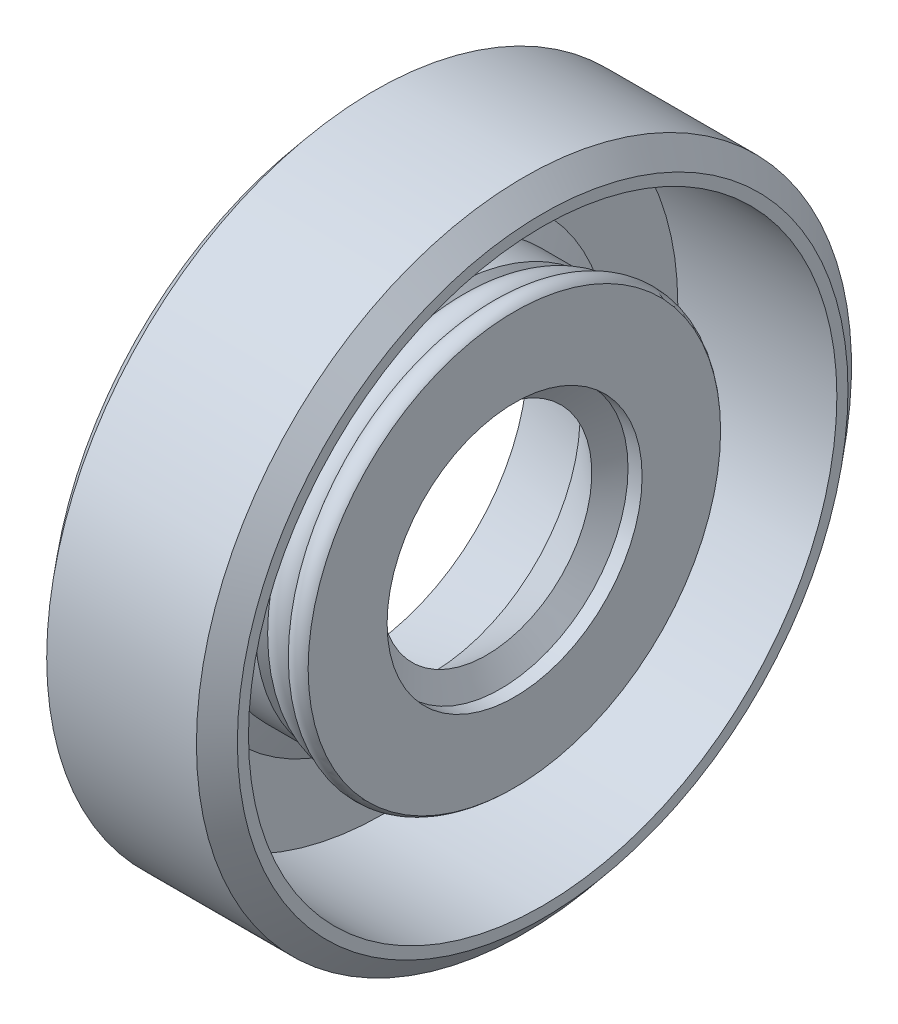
ISO-10303-21;
HEADER;
FILE_DESCRIPTION(('STEP AP214'),'2;1');
FILE_NAME('part.step','',(''),(''),'','','');
FILE_SCHEMA(('AUTOMOTIVE_DESIGN { 1 0 10303 214 1 1 1 1 }'));
ENDSEC;
DATA;
#1=APPLICATION_CONTEXT('core data for automotive mechanical design processes');
#2=APPLICATION_PROTOCOL_DEFINITION('international standard','automotive_design',2000,#1);
#3=PRODUCT_CONTEXT('',#1,'mechanical');
#4=PRODUCT('Part','Part','',(#3));
#5=PRODUCT_RELATED_PRODUCT_CATEGORY('part','',(#4));
#6=PRODUCT_DEFINITION_FORMATION('','',#4);
#7=PRODUCT_DEFINITION_CONTEXT('part definition',#1,'design');
#8=PRODUCT_DEFINITION('design','',#6,#7);
#9=PRODUCT_DEFINITION_SHAPE('','',#8);
#10=(LENGTH_UNIT() NAMED_UNIT(*) SI_UNIT(.MILLI.,.METRE.));
#11=(NAMED_UNIT(*) PLANE_ANGLE_UNIT() SI_UNIT($,.RADIAN.));
#12=(NAMED_UNIT(*) SI_UNIT($,.STERADIAN.) SOLID_ANGLE_UNIT());
#13=UNCERTAINTY_MEASURE_WITH_UNIT(LENGTH_MEASURE(1.E-05),#10,'distance_accuracy_value','');
#14=(GEOMETRIC_REPRESENTATION_CONTEXT(3) GLOBAL_UNCERTAINTY_ASSIGNED_CONTEXT((#13)) GLOBAL_UNIT_ASSIGNED_CONTEXT((#10,
#11,#12)) REPRESENTATION_CONTEXT('',''));
#15=CARTESIAN_POINT('',(0.,0.,0.));
#16=DIRECTION('',(0.,0.,1.));
#17=DIRECTION('',(1.,0.,0.));
#18=AXIS2_PLACEMENT_3D('',#15,#16,#17);
#19=CARTESIAN_POINT('',(8.,0.,0.));
#20=DIRECTION('',(-1.,0.,0.));
#21=DIRECTION('',(0.,0.,1.));
#22=AXIS2_PLACEMENT_3D('',#19,#20,#21);
#23=CYLINDRICAL_SURFACE('',#22,14.);
#24=CARTESIAN_POINT('',(0.8,0.,0.));
#25=DIRECTION('',(-1.,0.,0.));
#26=DIRECTION('',(0.,0.,1.));
#27=AXIS2_PLACEMENT_3D('',#24,#25,#26);
#28=CIRCLE('',#27,14.);
#29=CARTESIAN_POINT('',(0.8,0.,14.));
#30=VERTEX_POINT('',#29);
#31=EDGE_CURVE('E10',#30,#30,#28,.T.);
#32=ORIENTED_EDGE('',*,*,#31,.F.);
#33=EDGE_LOOP('',(#32));
#34=FACE_BOUND('',#33,.T.);
#35=CARTESIAN_POINT('',(7.2,0.,0.));
#36=DIRECTION('',(-1.,0.,0.));
#37=DIRECTION('',(0.,0.,1.));
#38=AXIS2_PLACEMENT_3D('',#35,#36,#37);
#39=CIRCLE('',#38,14.);
#40=CARTESIAN_POINT('',(7.2,0.,14.));
#41=VERTEX_POINT('',#40);
#42=EDGE_CURVE('E73',#41,#41,#39,.T.);
#43=ORIENTED_EDGE('',*,*,#42,.T.);
#44=EDGE_LOOP('',(#43));
#45=FACE_BOUND('',#44,.T.);
#46=ADVANCED_FACE('F15',(#34,#45),#23,.T.);
#47=CARTESIAN_POINT('',(0.8,0.,0.));
#48=DIRECTION('',(1.,0.,0.));
#49=DIRECTION('',(0.,0.,-1.));
#50=AXIS2_PLACEMENT_3D('',#47,#48,#49);
#51=CONICAL_SURFACE('',#50,14.,0.870903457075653);
#52=CARTESIAN_POINT('',(0.,0.,0.));
#53=DIRECTION('',(-1.,0.,0.));
#54=DIRECTION('',(0.,0.,1.));
#55=AXIS2_PLACEMENT_3D('',#52,#53,#54);
#56=CIRCLE('',#55,13.05);
#57=CARTESIAN_POINT('',(0.,0.,13.05));
#58=VERTEX_POINT('',#57);
#59=EDGE_CURVE('E21',#58,#58,#56,.T.);
#60=ORIENTED_EDGE('',*,*,#59,.F.);
#61=EDGE_LOOP('',(#60));
#62=FACE_BOUND('',#61,.T.);
#63=ORIENTED_EDGE('',*,*,#31,.T.);
#64=EDGE_LOOP('',(#63));
#65=FACE_BOUND('',#64,.T.);
#66=ADVANCED_FACE('F170',(#62,#65),#51,.T.);
#67=CARTESIAN_POINT('',(0.,13.05,0.));
#68=DIRECTION('',(1.,0.,0.));
#69=DIRECTION('',(0.,0.,-1.));
#70=AXIS2_PLACEMENT_3D('',#67,#68,#69);
#71=PLANE('',#70);
#72=CARTESIAN_POINT('',(0.,0.,0.));
#73=DIRECTION('',(-1.,0.,0.));
#74=DIRECTION('',(0.,0.,1.));
#75=AXIS2_PLACEMENT_3D('',#72,#73,#74);
#76=CIRCLE('',#75,7.35);
#77=CARTESIAN_POINT('',(0.,0.,7.35));
#78=VERTEX_POINT('',#77);
#79=EDGE_CURVE('E25',#78,#78,#76,.T.);
#80=ORIENTED_EDGE('',*,*,#79,.F.);
#81=EDGE_LOOP('',(#80));
#82=FACE_BOUND('',#81,.T.);
#83=ORIENTED_EDGE('',*,*,#59,.T.);
#84=EDGE_LOOP('',(#83));
#85=FACE_BOUND('',#84,.T.);
#86=ADVANCED_FACE('F165',(#82,#85),#71,.F.);
#87=CARTESIAN_POINT('',(0.,0.,0.));
#88=DIRECTION('',(-1.,0.,0.));
#89=DIRECTION('',(0.,0.,1.));
#90=AXIS2_PLACEMENT_3D('',#87,#88,#89);
#91=CONICAL_SURFACE('',#90,7.35,0.288587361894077);
#92=CARTESIAN_POINT('',(3.2,0.,0.));
#93=DIRECTION('',(-1.,0.,0.));
#94=DIRECTION('',(0.,0.,1.));
#95=AXIS2_PLACEMENT_3D('',#92,#93,#94);
#96=CIRCLE('',#95,6.4);
#97=CARTESIAN_POINT('',(3.2,0.,6.4));
#98=VERTEX_POINT('',#97);
#99=EDGE_CURVE('E29',#98,#98,#96,.T.);
#100=ORIENTED_EDGE('',*,*,#99,.F.);
#101=EDGE_LOOP('',(#100));
#102=FACE_BOUND('',#101,.T.);
#103=ORIENTED_EDGE('',*,*,#79,.T.);
#104=EDGE_LOOP('',(#103));
#105=FACE_BOUND('',#104,.T.);
#106=ADVANCED_FACE('F159',(#102,#105),#91,.F.);
#107=CARTESIAN_POINT('',(4.4,0.,0.));
#108=DIRECTION('',(-1.,0.,0.));
#109=DIRECTION('',(0.,0.,1.));
#110=AXIS2_PLACEMENT_3D('',#107,#108,#109);
#111=CONICAL_SURFACE('',#110,5.45,0.669638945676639);
#112=CARTESIAN_POINT('',(5.6,0.,0.));
#113=DIRECTION('',(-1.,0.,0.));
#114=DIRECTION('',(0.,0.,1.));
#115=AXIS2_PLACEMENT_3D('',#112,#113,#114);
#116=CIRCLE('',#115,4.5);
#117=CARTESIAN_POINT('',(5.6,0.,4.5));
#118=VERTEX_POINT('',#117);
#119=EDGE_CURVE('E34',#118,#118,#116,.T.);
#120=ORIENTED_EDGE('',*,*,#119,.F.);
#121=EDGE_LOOP('',(#120));
#122=FACE_BOUND('',#121,.T.);
#123=ORIENTED_EDGE('',*,*,#99,.T.);
#124=EDGE_LOOP('',(#123));
#125=FACE_BOUND('',#124,.T.);
#126=ADVANCED_FACE('F153',(#122,#125),#111,.F.);
#127=CARTESIAN_POINT('',(5.6,0.,0.));
#128=DIRECTION('',(1.,0.,0.));
#129=DIRECTION('',(0.,0.,-1.));
#130=AXIS2_PLACEMENT_3D('',#127,#128,#129);
#131=CONICAL_SURFACE('',#130,4.5,1.00662521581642);
#132=CARTESIAN_POINT('',(6.20000267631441,0.,0.));
#133=DIRECTION('',(-1.,0.,0.));
#134=DIRECTION('',(0.,0.,1.));
#135=AXIS2_PLACEMENT_3D('',#132,#133,#134);
#136=CIRCLE('',#135,5.44820791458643);
#137=CARTESIAN_POINT('',(6.20000267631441,0.,5.44820791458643));
#138=VERTEX_POINT('',#137);
#139=EDGE_CURVE('E37',#138,#138,#136,.T.);
#140=ORIENTED_EDGE('',*,*,#139,.F.);
#141=EDGE_LOOP('',(#140));
#142=FACE_BOUND('',#141,.T.);
#143=ORIENTED_EDGE('',*,*,#119,.T.);
#144=EDGE_LOOP('',(#143));
#145=FACE_BOUND('',#144,.T.);
#146=ADVANCED_FACE('F147',(#142,#145),#131,.F.);
#147=CARTESIAN_POINT('',(6.20000267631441,0.,0.));
#148=DIRECTION('',(1.,0.,0.));
#149=DIRECTION('',(0.,0.,-1.));
#150=AXIS2_PLACEMENT_3D('',#147,#148,#149);
#151=CONICAL_SURFACE('',#150,5.44820791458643,0.00298681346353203);
#152=CARTESIAN_POINT('',(6.8,0.,0.));
#153=DIRECTION('',(-1.,0.,0.));
#154=DIRECTION('',(0.,0.,1.));
#155=AXIS2_PLACEMENT_3D('',#152,#153,#154);
#156=CIRCLE('',#155,5.45);
#157=CARTESIAN_POINT('',(6.8,0.,5.45));
#158=VERTEX_POINT('',#157);
#159=EDGE_CURVE('E40',#158,#158,#156,.T.);
#160=ORIENTED_EDGE('',*,*,#159,.F.);
#161=EDGE_LOOP('',(#160));
#162=FACE_BOUND('',#161,.T.);
#163=ORIENTED_EDGE('',*,*,#139,.T.);
#164=EDGE_LOOP('',(#163));
#165=FACE_BOUND('',#164,.T.);
#166=ADVANCED_FACE('F141',(#162,#165),#151,.F.);
#167=CARTESIAN_POINT('',(6.8,0.,0.));
#168=DIRECTION('',(-1.,0.,0.));
#169=DIRECTION('',(0.,0.,1.));
#170=AXIS2_PLACEMENT_3D('',#167,#168,#169);
#171=CONICAL_SURFACE('',#170,5.45,1.56780951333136);
#172=CARTESIAN_POINT('',(6.78994949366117,0.,0.));
#173=DIRECTION('',(-1.,0.,0.));
#174=DIRECTION('',(0.,0.,1.));
#175=AXIS2_PLACEMENT_3D('',#172,#173,#174);
#176=CIRCLE('',#175,8.81494949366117);
#177=CARTESIAN_POINT('',(6.78994949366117,0.,8.81494949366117));
#178=VERTEX_POINT('',#177);
#179=EDGE_CURVE('E43',#178,#178,#176,.T.);
#180=ORIENTED_EDGE('',*,*,#179,.F.);
#181=EDGE_LOOP('',(#180));
#182=FACE_BOUND('',#181,.T.);
#183=ORIENTED_EDGE('',*,*,#159,.T.);
#184=EDGE_LOOP('',(#183));
#185=FACE_BOUND('',#184,.T.);
#186=ADVANCED_FACE('F135',(#182,#185),#171,.T.);
#187=CARTESIAN_POINT('',(6.36568542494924,0.,0.));
#188=DIRECTION('',(-1.,0.,0.));
#189=DIRECTION('',(0.,0.,1.));
#190=AXIS2_PLACEMENT_3D('',#187,#188,#189);
#191=TOROIDAL_SURFACE('',#190,8.39068542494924,0.6);
#192=CARTESIAN_POINT('',(5.76568542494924,0.,0.));
#193=DIRECTION('',(-1.,0.,0.));
#194=DIRECTION('',(0.,0.,1.));
#195=AXIS2_PLACEMENT_3D('',#192,#193,#194);
#196=CIRCLE('',#195,8.39068542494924);
#197=CARTESIAN_POINT('',(5.76568542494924,0.,8.39068542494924));
#198=VERTEX_POINT('',#197);
#199=EDGE_CURVE('E46',#198,#198,#196,.T.);
#200=ORIENTED_EDGE('',*,*,#199,.F.);
#201=EDGE_LOOP('',(#200));
#202=FACE_BOUND('',#201,.T.);
#203=ORIENTED_EDGE('',*,*,#179,.T.);
#204=EDGE_LOOP('',(#203));
#205=FACE_BOUND('',#204,.T.);
#206=ADVANCED_FACE('F129',(#202,#205),#191,.T.);
#207=CARTESIAN_POINT('',(5.2,0.,0.));
#208=DIRECTION('',(-1.,0.,0.));
#209=DIRECTION('',(0.,0.,1.));
#210=AXIS2_PLACEMENT_3D('',#207,#208,#209);
#211=TOROIDAL_SURFACE('',#210,7.825,0.8);
#212=CARTESIAN_POINT('',(4.4,0.,0.));
#213=DIRECTION('',(-1.,0.,0.));
#214=DIRECTION('',(0.,0.,1.));
#215=AXIS2_PLACEMENT_3D('',#212,#213,#214);
#216=CIRCLE('',#215,7.825);
#217=CARTESIAN_POINT('',(4.4,0.,7.825));
#218=VERTEX_POINT('',#217);
#219=EDGE_CURVE('E49',#218,#218,#216,.T.);
#220=ORIENTED_EDGE('',*,*,#219,.F.);
#221=EDGE_LOOP('',(#220));
#222=FACE_BOUND('',#221,.T.);
#223=ORIENTED_EDGE('',*,*,#199,.T.);
#224=EDGE_LOOP('',(#223));
#225=FACE_BOUND('',#224,.T.);
#226=ADVANCED_FACE('F123',(#222,#225),#211,.T.);
#227=CARTESIAN_POINT('',(4.4,0.,0.));
#228=DIRECTION('',(-1.,0.,0.));
#229=DIRECTION('',(0.,0.,1.));
#230=AXIS2_PLACEMENT_3D('',#227,#228,#229);
#231=CONICAL_SURFACE('',#230,7.825,0.870903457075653);
#232=CARTESIAN_POINT('',(4.,0.,0.));
#233=DIRECTION('',(-1.,0.,0.));
#234=DIRECTION('',(0.,0.,1.));
#235=AXIS2_PLACEMENT_3D('',#232,#233,#234);
#236=CIRCLE('',#235,8.3);
#237=CARTESIAN_POINT('',(4.,0.,8.3));
#238=VERTEX_POINT('',#237);
#239=EDGE_CURVE('E52',#238,#238,#236,.T.);
#240=ORIENTED_EDGE('',*,*,#239,.F.);
#241=EDGE_LOOP('',(#240));
#242=FACE_BOUND('',#241,.T.);
#243=ORIENTED_EDGE('',*,*,#219,.T.);
#244=EDGE_LOOP('',(#243));
#245=FACE_BOUND('',#244,.T.);
#246=ADVANCED_FACE('F117',(#242,#245),#231,.T.);
#247=CARTESIAN_POINT('',(8.,0.,0.));
#248=DIRECTION('',(-1.,0.,0.));
#249=DIRECTION('',(0.,0.,1.));
#250=AXIS2_PLACEMENT_3D('',#247,#248,#249);
#251=CYLINDRICAL_SURFACE('',#250,8.3);
#252=CARTESIAN_POINT('',(2.,0.,0.));
#253=DIRECTION('',(-1.,0.,0.));
#254=DIRECTION('',(0.,0.,1.));
#255=AXIS2_PLACEMENT_3D('',#252,#253,#254);
#256=CIRCLE('',#255,8.3);
#257=CARTESIAN_POINT('',(2.,0.,8.3));
#258=VERTEX_POINT('',#257);
#259=EDGE_CURVE('E55',#258,#258,#256,.T.);
#260=ORIENTED_EDGE('',*,*,#259,.F.);
#261=EDGE_LOOP('',(#260));
#262=FACE_BOUND('',#261,.T.);
#263=ORIENTED_EDGE('',*,*,#239,.T.);
#264=EDGE_LOOP('',(#263));
#265=FACE_BOUND('',#264,.T.);
#266=ADVANCED_FACE('F111',(#262,#265),#251,.T.);
#267=CARTESIAN_POINT('',(2.,0.,0.));
#268=DIRECTION('',(-1.,0.,0.));
#269=DIRECTION('',(0.,0.,1.));
#270=AXIS2_PLACEMENT_3D('',#267,#268,#269);
#271=CONICAL_SURFACE('',#270,8.3,1.17227388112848);
#272=CARTESIAN_POINT('',(1.6,0.,0.));
#273=DIRECTION('',(-1.,0.,0.));
#274=DIRECTION('',(0.,0.,1.));
#275=AXIS2_PLACEMENT_3D('',#272,#273,#274);
#276=CIRCLE('',#275,9.25);
#277=CARTESIAN_POINT('',(1.6,0.,9.25));
#278=VERTEX_POINT('',#277);
#279=EDGE_CURVE('E58',#278,#278,#276,.T.);
#280=ORIENTED_EDGE('',*,*,#279,.F.);
#281=EDGE_LOOP('',(#280));
#282=FACE_BOUND('',#281,.T.);
#283=ORIENTED_EDGE('',*,*,#259,.T.);
#284=EDGE_LOOP('',(#283));
#285=FACE_BOUND('',#284,.T.);
#286=ADVANCED_FACE('F105',(#282,#285),#271,.T.);
#287=CARTESIAN_POINT('',(8.,0.,0.));
#288=DIRECTION('',(-1.,0.,0.));
#289=DIRECTION('',(0.,0.,1.));
#290=AXIS2_PLACEMENT_3D('',#287,#288,#289);
#291=CYLINDRICAL_SURFACE('',#290,9.25);
#292=CARTESIAN_POINT('',(1.2,0.,0.));
#293=DIRECTION('',(-1.,0.,0.));
#294=DIRECTION('',(0.,0.,1.));
#295=AXIS2_PLACEMENT_3D('',#292,#293,#294);
#296=CIRCLE('',#295,9.25);
#297=CARTESIAN_POINT('',(1.2,0.,9.25));
#298=VERTEX_POINT('',#297);
#299=EDGE_CURVE('E61',#298,#298,#296,.T.);
#300=ORIENTED_EDGE('',*,*,#299,.F.);
#301=EDGE_LOOP('',(#300));
#302=FACE_BOUND('',#301,.T.);
#303=ORIENTED_EDGE('',*,*,#279,.T.);
#304=EDGE_LOOP('',(#303));
#305=FACE_BOUND('',#304,.T.);
#306=ADVANCED_FACE('F99',(#302,#305),#291,.T.);
#307=CARTESIAN_POINT('',(1.2,9.25,0.));
#308=DIRECTION('',(-1.,0.,0.));
#309=DIRECTION('',(0.,0.,1.));
#310=AXIS2_PLACEMENT_3D('',#307,#308,#309);
#311=PLANE('',#310);
#312=CARTESIAN_POINT('',(1.2,0.,0.));
#313=DIRECTION('',(-1.,0.,0.));
#314=DIRECTION('',(0.,0.,1.));
#315=AXIS2_PLACEMENT_3D('',#312,#313,#314);
#316=CIRCLE('',#315,12.575);
#317=CARTESIAN_POINT('',(1.2,0.,12.575));
#318=VERTEX_POINT('',#317);
#319=EDGE_CURVE('E64',#318,#318,#316,.T.);
#320=ORIENTED_EDGE('',*,*,#319,.F.);
#321=EDGE_LOOP('',(#320));
#322=FACE_BOUND('',#321,.T.);
#323=ORIENTED_EDGE('',*,*,#299,.T.);
#324=EDGE_LOOP('',(#323));
#325=FACE_BOUND('',#324,.T.);
#326=ADVANCED_FACE('F93',(#322,#325),#311,.F.);
#327=CARTESIAN_POINT('',(8.,0.,0.));
#328=DIRECTION('',(-1.,0.,0.));
#329=DIRECTION('',(0.,0.,1.));
#330=AXIS2_PLACEMENT_3D('',#327,#328,#329);
#331=CYLINDRICAL_SURFACE('',#330,12.575);
#332=CARTESIAN_POINT('',(8.,0.,0.));
#333=DIRECTION('',(-1.,0.,0.));
#334=DIRECTION('',(0.,0.,1.));
#335=AXIS2_PLACEMENT_3D('',#332,#333,#334);
#336=CIRCLE('',#335,12.575);
#337=CARTESIAN_POINT('',(8.,0.,12.575));
#338=VERTEX_POINT('',#337);
#339=EDGE_CURVE('E67',#338,#338,#336,.T.);
#340=ORIENTED_EDGE('',*,*,#339,.F.);
#341=EDGE_LOOP('',(#340));
#342=FACE_BOUND('',#341,.T.);
#343=ORIENTED_EDGE('',*,*,#319,.T.);
#344=EDGE_LOOP('',(#343));
#345=FACE_BOUND('',#344,.T.);
#346=ADVANCED_FACE('F87',(#342,#345),#331,.F.);
#347=CARTESIAN_POINT('',(8.,12.575,0.));
#348=DIRECTION('',(-1.,0.,0.));
#349=DIRECTION('',(0.,0.,1.));
#350=AXIS2_PLACEMENT_3D('',#347,#348,#349);
#351=PLANE('',#350);
#352=CARTESIAN_POINT('',(8.,0.,0.));
#353=DIRECTION('',(-1.,0.,0.));
#354=DIRECTION('',(0.,0.,1.));
#355=AXIS2_PLACEMENT_3D('',#352,#353,#354);
#356=CIRCLE('',#355,13.05);
#357=CARTESIAN_POINT('',(8.,0.,13.05));
#358=VERTEX_POINT('',#357);
#359=EDGE_CURVE('E70',#358,#358,#356,.T.);
#360=ORIENTED_EDGE('',*,*,#359,.F.);
#361=EDGE_LOOP('',(#360));
#362=FACE_BOUND('',#361,.T.);
#363=ORIENTED_EDGE('',*,*,#339,.T.);
#364=EDGE_LOOP('',(#363));
#365=FACE_BOUND('',#364,.T.);
#366=ADVANCED_FACE('F81',(#362,#365),#351,.F.);
#367=CARTESIAN_POINT('',(8.,0.,0.));
#368=DIRECTION('',(-1.,0.,0.));
#369=DIRECTION('',(0.,0.,1.));
#370=AXIS2_PLACEMENT_3D('',#367,#368,#369);
#371=CONICAL_SURFACE('',#370,13.05,0.870903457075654);
#372=ORIENTED_EDGE('',*,*,#42,.F.);
#373=EDGE_LOOP('',(#372));
#374=FACE_BOUND('',#373,.T.);
#375=ORIENTED_EDGE('',*,*,#359,.T.);
#376=EDGE_LOOP('',(#375));
#377=FACE_BOUND('',#376,.T.);
#378=ADVANCED_FACE('F78',(#374,#377),#371,.T.);
#379=CLOSED_SHELL('',(#46,#66,#86,#106,#126,#146,#166,#186,#206,#226,#246,#266,#286,#306,#326,
#346,#366,#378));
#380=MANIFOLD_SOLID_BREP('B1',#379);
#381=ADVANCED_BREP_SHAPE_REPRESENTATION('',(#18,#380),#14);
#382=SHAPE_DEFINITION_REPRESENTATION(#9,#381);
ENDSEC;
END-ISO-10303-21;
